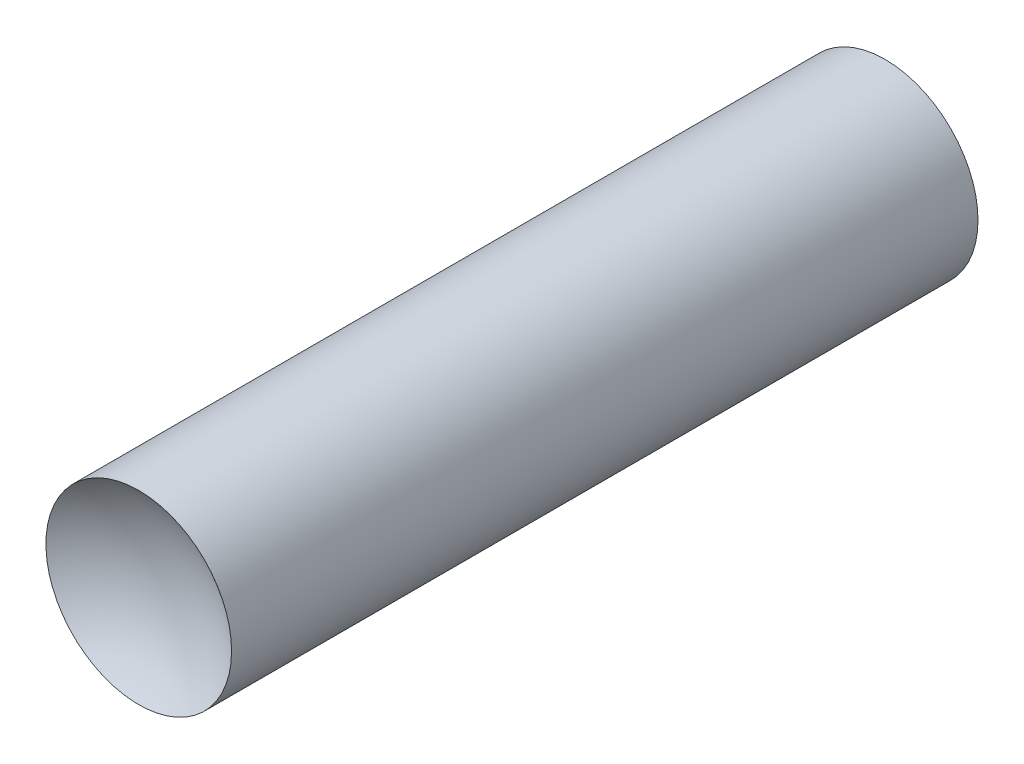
from build123d import *


with BuildPart() as part:
    # Sketch 1 → Revolve 1 (revolve)
    with BuildSketch(Plane(origin=(0, 0, 0), x_dir=(0, 0, -1), z_dir=(1, 0, 0))):
        with BuildLine():
            Line((-4.421936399, 0), (4.421936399, 0))
            ThreePointArc((4.421936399, 0), (4.525663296, 0.633172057), (4.826, 1.20015))
            Line((4.826, 1.20015), (-4.826, 1.20015))
            ThreePointArc((-4.826, 1.20015), (-4.525663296, 0.633172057), (-4.421936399, 0))
        make_face()
    revolve(axis=Axis((0, 0, 38.92214443), (0, 0, -1)))


solid = part.part
